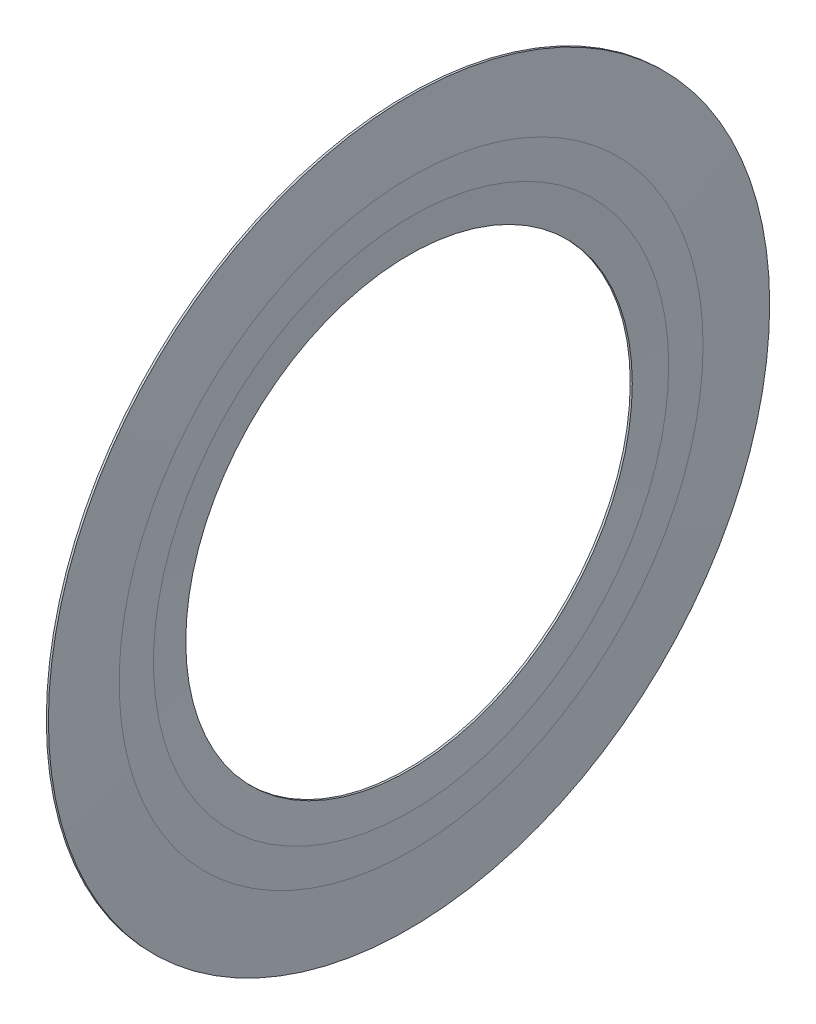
ISO-10303-21;
HEADER;
FILE_DESCRIPTION(('STEP AP214'),'2;1');
FILE_NAME('part.step','',(''),(''),'','','');
FILE_SCHEMA(('AUTOMOTIVE_DESIGN { 1 0 10303 214 1 1 1 1 }'));
ENDSEC;
DATA;
#1=APPLICATION_CONTEXT('core data for automotive mechanical design processes');
#2=APPLICATION_PROTOCOL_DEFINITION('international standard','automotive_design',2000,#1);
#3=PRODUCT_CONTEXT('',#1,'mechanical');
#4=PRODUCT('Part','Part','',(#3));
#5=PRODUCT_RELATED_PRODUCT_CATEGORY('part','',(#4));
#6=PRODUCT_DEFINITION_FORMATION('','',#4);
#7=PRODUCT_DEFINITION_CONTEXT('part definition',#1,'design');
#8=PRODUCT_DEFINITION('design','',#6,#7);
#9=PRODUCT_DEFINITION_SHAPE('','',#8);
#10=(LENGTH_UNIT() NAMED_UNIT(*) SI_UNIT(.MILLI.,.METRE.));
#11=(NAMED_UNIT(*) PLANE_ANGLE_UNIT() SI_UNIT($,.RADIAN.));
#12=(NAMED_UNIT(*) SI_UNIT($,.STERADIAN.) SOLID_ANGLE_UNIT());
#13=UNCERTAINTY_MEASURE_WITH_UNIT(LENGTH_MEASURE(1.E-05),#10,'distance_accuracy_value','');
#14=(GEOMETRIC_REPRESENTATION_CONTEXT(3) GLOBAL_UNCERTAINTY_ASSIGNED_CONTEXT((#13)) GLOBAL_UNIT_ASSIGNED_CONTEXT((#10,
#11,#12)) REPRESENTATION_CONTEXT('',''));
#15=CARTESIAN_POINT('',(0.,0.,0.));
#16=DIRECTION('',(0.,0.,1.));
#17=DIRECTION('',(1.,0.,0.));
#18=AXIS2_PLACEMENT_3D('',#15,#16,#17);
#19=CARTESIAN_POINT('',(-4.,10.5,0.));
#20=DIRECTION('',(-1.,0.,0.));
#21=DIRECTION('',(0.,0.,1.));
#22=AXIS2_PLACEMENT_3D('',#19,#20,#21);
#23=PLANE('',#22);
#24=CARTESIAN_POINT('',(-4.,0.,0.));
#25=DIRECTION('',(1.,0.,0.));
#26=DIRECTION('',(0.,0.,-1.));
#27=AXIS2_PLACEMENT_3D('',#24,#25,#26);
#28=CIRCLE('',#27,8.5);
#29=CARTESIAN_POINT('',(-4.,0.,-8.5));
#30=VERTEX_POINT('',#29);
#31=EDGE_CURVE('E5',#30,#30,#28,.T.);
#32=ORIENTED_EDGE('',*,*,#31,.T.);
#33=EDGE_LOOP('',(#32));
#34=FACE_BOUND('',#33,.T.);
#35=CARTESIAN_POINT('',(-4.,0.,0.));
#36=DIRECTION('',(1.,0.,0.));
#37=DIRECTION('',(0.,0.,-1.));
#38=AXIS2_PLACEMENT_3D('',#35,#36,#37);
#39=CIRCLE('',#38,10.5);
#40=CARTESIAN_POINT('',(-4.,0.,-10.5));
#41=VERTEX_POINT('',#40);
#42=EDGE_CURVE('E9',#41,#41,#39,.T.);
#43=ORIENTED_EDGE('',*,*,#42,.F.);
#44=EDGE_LOOP('',(#43));
#45=FACE_BOUND('',#44,.T.);
#46=ADVANCED_FACE('F13',(#34,#45),#23,.T.);
#47=CARTESIAN_POINT('',(-4.,0.,0.));
#48=DIRECTION('',(-1.,0.,0.));
#49=DIRECTION('',(0.,0.,1.));
#50=AXIS2_PLACEMENT_3D('',#47,#48,#49);
#51=CONICAL_SURFACE('',#50,8.5,1.54080532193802);
#52=CARTESIAN_POINT('',(-3.97,0.,0.));
#53=DIRECTION('',(1.,0.,0.));
#54=DIRECTION('',(0.,0.,-1.));
#55=AXIS2_PLACEMENT_3D('',#52,#53,#54);
#56=CIRCLE('',#55,7.5);
#57=CARTESIAN_POINT('',(-3.97,0.,-7.5));
#58=VERTEX_POINT('',#57);
#59=EDGE_CURVE('E24',#58,#58,#56,.T.);
#60=ORIENTED_EDGE('',*,*,#59,.T.);
#61=EDGE_LOOP('',(#60));
#62=FACE_BOUND('',#61,.T.);
#63=ORIENTED_EDGE('',*,*,#31,.F.);
#64=EDGE_LOOP('',(#63));
#65=FACE_BOUND('',#64,.T.);
#66=ADVANCED_FACE('F30',(#62,#65),#51,.F.);
#67=CARTESIAN_POINT('',(0.5,0.,0.));
#68=DIRECTION('',(1.,0.,0.));
#69=DIRECTION('',(0.,0.,-1.));
#70=AXIS2_PLACEMENT_3D('',#67,#68,#69);
#71=CYLINDRICAL_SURFACE('',#70,10.5);
#72=ORIENTED_EDGE('',*,*,#42,.T.);
#73=EDGE_LOOP('',(#72));
#74=FACE_BOUND('',#73,.T.);
#75=CARTESIAN_POINT('',(-3.94,0.,0.));
#76=DIRECTION('',(1.,0.,0.));
#77=DIRECTION('',(0.,0.,-1.));
#78=AXIS2_PLACEMENT_3D('',#75,#76,#77);
#79=CIRCLE('',#78,10.5);
#80=CARTESIAN_POINT('',(-3.94,0.,-10.5));
#81=VERTEX_POINT('',#80);
#82=EDGE_CURVE('E39',#81,#81,#79,.T.);
#83=ORIENTED_EDGE('',*,*,#82,.F.);
#84=EDGE_LOOP('',(#83));
#85=FACE_BOUND('',#84,.T.);
#86=ADVANCED_FACE('F43',(#74,#85),#71,.T.);
#87=CARTESIAN_POINT('',(-3.97,0.,0.));
#88=DIRECTION('',(1.,0.,0.));
#89=DIRECTION('',(0.,0.,-1.));
#90=AXIS2_PLACEMENT_3D('',#87,#88,#89);
#91=CONICAL_SURFACE('',#90,7.5,1.54080532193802);
#92=CARTESIAN_POINT('',(-4.,0.,0.));
#93=DIRECTION('',(1.,0.,0.));
#94=DIRECTION('',(0.,0.,-1.));
#95=AXIS2_PLACEMENT_3D('',#92,#93,#94);
#96=CIRCLE('',#95,6.5);
#97=CARTESIAN_POINT('',(-4.,0.,-6.5));
#98=VERTEX_POINT('',#97);
#99=EDGE_CURVE('E50',#98,#98,#96,.T.);
#100=ORIENTED_EDGE('',*,*,#99,.T.);
#101=EDGE_LOOP('',(#100));
#102=FACE_BOUND('',#101,.T.);
#103=ORIENTED_EDGE('',*,*,#59,.F.);
#104=EDGE_LOOP('',(#103));
#105=FACE_BOUND('',#104,.T.);
#106=ADVANCED_FACE('F56',(#102,#105),#91,.T.);
#107=CARTESIAN_POINT('',(-3.88,0.,0.));
#108=DIRECTION('',(-1.,0.,0.));
#109=DIRECTION('',(0.,0.,1.));
#110=AXIS2_PLACEMENT_3D('',#107,#108,#109);
#111=CONICAL_SURFACE('',#110,8.5,1.54080532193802);
#112=ORIENTED_EDGE('',*,*,#82,.T.);
#113=EDGE_LOOP('',(#112));
#114=FACE_BOUND('',#113,.T.);
#115=CARTESIAN_POINT('',(-3.88,0.,0.));
#116=DIRECTION('',(1.,0.,0.));
#117=DIRECTION('',(0.,0.,-1.));
#118=AXIS2_PLACEMENT_3D('',#115,#116,#117);
#119=CIRCLE('',#118,8.5);
#120=CARTESIAN_POINT('',(-3.88,0.,-8.5));
#121=VERTEX_POINT('',#120);
#122=EDGE_CURVE('E65',#121,#121,#119,.T.);
#123=ORIENTED_EDGE('',*,*,#122,.F.);
#124=EDGE_LOOP('',(#123));
#125=FACE_BOUND('',#124,.T.);
#126=ADVANCED_FACE('F69',(#114,#125),#111,.T.);
#127=CARTESIAN_POINT('',(0.5,0.,0.));
#128=DIRECTION('',(1.,0.,0.));
#129=DIRECTION('',(0.,0.,-1.));
#130=AXIS2_PLACEMENT_3D('',#127,#128,#129);
#131=CYLINDRICAL_SURFACE('',#130,6.5);
#132=CARTESIAN_POINT('',(-3.94,0.,0.));
#133=DIRECTION('',(1.,0.,0.));
#134=DIRECTION('',(0.,0.,-1.));
#135=AXIS2_PLACEMENT_3D('',#132,#133,#134);
#136=CIRCLE('',#135,6.5);
#137=CARTESIAN_POINT('',(-3.94,0.,-6.5));
#138=VERTEX_POINT('',#137);
#139=EDGE_CURVE('E76',#138,#138,#136,.T.);
#140=ORIENTED_EDGE('',*,*,#139,.T.);
#141=EDGE_LOOP('',(#140));
#142=FACE_BOUND('',#141,.T.);
#143=ORIENTED_EDGE('',*,*,#99,.F.);
#144=EDGE_LOOP('',(#143));
#145=FACE_BOUND('',#144,.T.);
#146=ADVANCED_FACE('F82',(#142,#145),#131,.F.);
#147=CARTESIAN_POINT('',(-3.88,7.5,0.));
#148=DIRECTION('',(1.,0.,0.));
#149=DIRECTION('',(0.,0.,-1.));
#150=AXIS2_PLACEMENT_3D('',#147,#148,#149);
#151=PLANE('',#150);
#152=ORIENTED_EDGE('',*,*,#122,.T.);
#153=EDGE_LOOP('',(#152));
#154=FACE_BOUND('',#153,.T.);
#155=CARTESIAN_POINT('',(-3.88,0.,0.));
#156=DIRECTION('',(1.,0.,0.));
#157=DIRECTION('',(0.,0.,-1.));
#158=AXIS2_PLACEMENT_3D('',#155,#156,#157);
#159=CIRCLE('',#158,7.50000000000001);
#160=CARTESIAN_POINT('',(-3.88,0.,-7.50000000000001));
#161=VERTEX_POINT('',#160);
#162=EDGE_CURVE('E91',#161,#161,#159,.T.);
#163=ORIENTED_EDGE('',*,*,#162,.F.);
#164=EDGE_LOOP('',(#163));
#165=FACE_BOUND('',#164,.T.);
#166=ADVANCED_FACE('F95',(#154,#165),#151,.T.);
#167=CARTESIAN_POINT('',(-3.94,0.,0.));
#168=DIRECTION('',(1.,0.,0.));
#169=DIRECTION('',(0.,0.,-1.));
#170=AXIS2_PLACEMENT_3D('',#167,#168,#169);
#171=CONICAL_SURFACE('',#170,6.5,1.51086817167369);
#172=ORIENTED_EDGE('',*,*,#162,.T.);
#173=EDGE_LOOP('',(#172));
#174=FACE_BOUND('',#173,.T.);
#175=ORIENTED_EDGE('',*,*,#139,.F.);
#176=EDGE_LOOP('',(#175));
#177=FACE_BOUND('',#176,.T.);
#178=ADVANCED_FACE('F106',(#174,#177),#171,.F.);
#179=CLOSED_SHELL('',(#46,#66,#86,#106,#126,#146,#166,#178));
#180=MANIFOLD_SOLID_BREP('B1',#179);
#181=ADVANCED_BREP_SHAPE_REPRESENTATION('',(#18,#180),#14);
#182=SHAPE_DEFINITION_REPRESENTATION(#9,#181);
ENDSEC;
END-ISO-10303-21;
